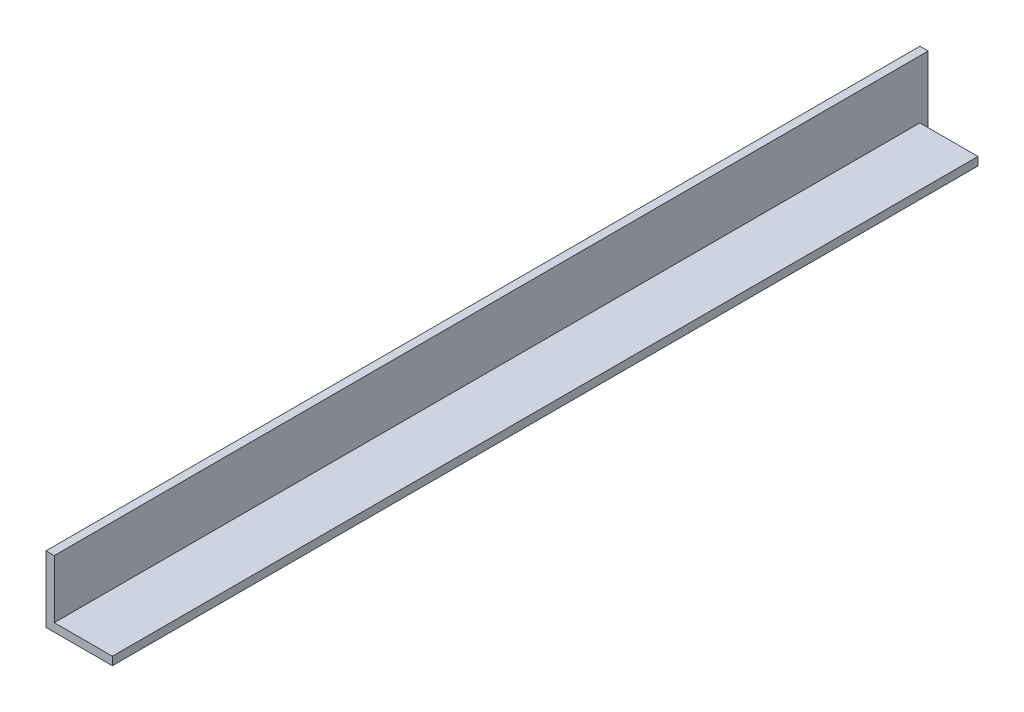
ISO-10303-21;
HEADER;
FILE_DESCRIPTION(('STEP AP214'),'2;1');
FILE_NAME('part.step','',(''),(''),'','','');
FILE_SCHEMA(('AUTOMOTIVE_DESIGN { 1 0 10303 214 1 1 1 1 }'));
ENDSEC;
DATA;
#1=APPLICATION_CONTEXT('core data for automotive mechanical design processes');
#2=APPLICATION_PROTOCOL_DEFINITION('international standard','automotive_design',2000,#1);
#3=PRODUCT_CONTEXT('',#1,'mechanical');
#4=PRODUCT('Part','Part','',(#3));
#5=PRODUCT_RELATED_PRODUCT_CATEGORY('part','',(#4));
#6=PRODUCT_DEFINITION_FORMATION('','',#4);
#7=PRODUCT_DEFINITION_CONTEXT('part definition',#1,'design');
#8=PRODUCT_DEFINITION('design','',#6,#7);
#9=PRODUCT_DEFINITION_SHAPE('','',#8);
#10=(LENGTH_UNIT() NAMED_UNIT(*) SI_UNIT(.MILLI.,.METRE.));
#11=(NAMED_UNIT(*) PLANE_ANGLE_UNIT() SI_UNIT($,.RADIAN.));
#12=(NAMED_UNIT(*) SI_UNIT($,.STERADIAN.) SOLID_ANGLE_UNIT());
#13=UNCERTAINTY_MEASURE_WITH_UNIT(LENGTH_MEASURE(1.E-05),#10,'distance_accuracy_value','');
#14=(GEOMETRIC_REPRESENTATION_CONTEXT(3) GLOBAL_UNCERTAINTY_ASSIGNED_CONTEXT((#13)) GLOBAL_UNIT_ASSIGNED_CONTEXT((#10,
#11,#12)) REPRESENTATION_CONTEXT('',''));
#15=CARTESIAN_POINT('',(0.,0.,0.));
#16=DIRECTION('',(0.,0.,1.));
#17=DIRECTION('',(1.,0.,0.));
#18=AXIS2_PLACEMENT_3D('',#15,#16,#17);
#19=CARTESIAN_POINT('',(0.,0.,501.65));
#20=DIRECTION('',(0.,1.,0.));
#21=DIRECTION('',(0.,0.,1.));
#22=AXIS2_PLACEMENT_3D('',#19,#20,#21);
#23=PLANE('',#22);
#24=DIRECTION('',(1.,0.,0.));
#25=VECTOR('',#24,1.);
#26=CARTESIAN_POINT('',(0.,0.,0.));
#27=LINE('',#26,#25);
#28=CARTESIAN_POINT('',(0.,0.,0.));
#29=VERTEX_POINT('',#28);
#30=CARTESIAN_POINT('',(4.7498,0.,0.));
#31=VERTEX_POINT('',#30);
#32=EDGE_CURVE('E115',#29,#31,#27,.T.);
#33=ORIENTED_EDGE('',*,*,#32,.T.);
#34=DIRECTION('',(0.,0.,-1.));
#35=VECTOR('',#34,1.);
#36=CARTESIAN_POINT('',(4.7498,0.,0.));
#37=LINE('',#36,#35);
#38=CARTESIAN_POINT('',(4.7498,0.,4.7752));
#39=VERTEX_POINT('',#38);
#40=EDGE_CURVE('E147',#39,#31,#37,.T.);
#41=ORIENTED_EDGE('',*,*,#40,.F.);
#42=DIRECTION('',(-1.,0.,0.));
#43=VECTOR('',#42,1.);
#44=CARTESIAN_POINT('',(4.7498,0.,4.7752));
#45=LINE('',#44,#43);
#46=CARTESIAN_POINT('',(38.1,0.,4.7752));
#47=VERTEX_POINT('',#46);
#48=EDGE_CURVE('E143',#47,#39,#45,.T.);
#49=ORIENTED_EDGE('',*,*,#48,.F.);
#50=DIRECTION('',(0.,0.,-1.));
#51=VECTOR('',#50,1.);
#52=CARTESIAN_POINT('',(38.1,0.,501.65));
#53=LINE('',#52,#51);
#54=CARTESIAN_POINT('',(38.1,0.,501.65));
#55=VERTEX_POINT('',#54);
#56=EDGE_CURVE('E11',#55,#47,#53,.T.);
#57=ORIENTED_EDGE('',*,*,#56,.F.);
#58=DIRECTION('',(1.,0.,0.));
#59=VECTOR('',#58,1.);
#60=CARTESIAN_POINT('',(0.,0.,501.65));
#61=LINE('',#60,#59);
#62=CARTESIAN_POINT('',(0.,0.,501.65));
#63=VERTEX_POINT('',#62);
#64=EDGE_CURVE('E123',#63,#55,#61,.T.);
#65=ORIENTED_EDGE('',*,*,#64,.F.);
#66=DIRECTION('',(0.,0.,-1.));
#67=VECTOR('',#66,1.);
#68=CARTESIAN_POINT('',(0.,0.,501.65));
#69=LINE('',#68,#67);
#70=EDGE_CURVE('E111',#63,#29,#69,.T.);
#71=ORIENTED_EDGE('',*,*,#70,.T.);
#72=EDGE_LOOP('',(#33,#41,#49,#57,#65,#71));
#73=FACE_BOUND('',#72,.T.);
#74=ADVANCED_FACE('F33',(#73),#23,.F.);
#75=CARTESIAN_POINT('',(38.1,0.,501.65));
#76=DIRECTION('',(-1.,0.,0.));
#77=DIRECTION('',(0.,0.,1.));
#78=AXIS2_PLACEMENT_3D('',#75,#76,#77);
#79=PLANE('',#78);
#80=ORIENTED_EDGE('',*,*,#56,.T.);
#81=DIRECTION('',(0.,-1.,0.));
#82=VECTOR('',#81,1.);
#83=CARTESIAN_POINT('',(38.1,38.1,4.7752));
#84=LINE('',#83,#82);
#85=CARTESIAN_POINT('',(38.1,4.74980000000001,4.7752));
#86=VERTEX_POINT('',#85);
#87=EDGE_CURVE('E136',#86,#47,#84,.T.);
#88=ORIENTED_EDGE('',*,*,#87,.F.);
#89=DIRECTION('',(0.,0.,-1.));
#90=VECTOR('',#89,1.);
#91=CARTESIAN_POINT('',(38.1,4.7498,501.65));
#92=LINE('',#91,#90);
#93=CARTESIAN_POINT('',(38.1,4.7498,501.65));
#94=VERTEX_POINT('',#93);
#95=EDGE_CURVE('E40',#94,#86,#92,.T.);
#96=ORIENTED_EDGE('',*,*,#95,.F.);
#97=DIRECTION('',(0.,1.,0.));
#98=VECTOR('',#97,1.);
#99=CARTESIAN_POINT('',(38.1,0.,501.65));
#100=LINE('',#99,#98);
#101=EDGE_CURVE('E82',#55,#94,#100,.T.);
#102=ORIENTED_EDGE('',*,*,#101,.F.);
#103=EDGE_LOOP('',(#80,#88,#96,#102));
#104=FACE_BOUND('',#103,.T.);
#105=ADVANCED_FACE('F134',(#104),#79,.F.);
#106=CARTESIAN_POINT('',(38.1,4.7498,501.65));
#107=DIRECTION('',(0.,-1.,0.));
#108=DIRECTION('',(1.,0.,0.));
#109=AXIS2_PLACEMENT_3D('',#106,#107,#108);
#110=PLANE('',#109);
#111=ORIENTED_EDGE('',*,*,#95,.T.);
#112=DIRECTION('',(-1.,0.,0.));
#113=VECTOR('',#112,1.);
#114=CARTESIAN_POINT('',(38.1,4.7498,4.77519999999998));
#115=LINE('',#114,#113);
#116=CARTESIAN_POINT('',(4.7498,4.74980000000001,4.7752));
#117=VERTEX_POINT('',#116);
#118=EDGE_CURVE('E118',#86,#117,#115,.T.);
#119=ORIENTED_EDGE('',*,*,#118,.T.);
#120=DIRECTION('',(0.,0.,-1.));
#121=VECTOR('',#120,1.);
#122=CARTESIAN_POINT('',(4.7498,4.7498,501.65));
#123=LINE('',#122,#121);
#124=CARTESIAN_POINT('',(4.7498,4.7498,501.65));
#125=VERTEX_POINT('',#124);
#126=EDGE_CURVE('E106',#125,#117,#123,.T.);
#127=ORIENTED_EDGE('',*,*,#126,.F.);
#128=DIRECTION('',(-1.,0.,0.));
#129=VECTOR('',#128,1.);
#130=CARTESIAN_POINT('',(38.1,4.7498,501.65));
#131=LINE('',#130,#129);
#132=EDGE_CURVE('E98',#94,#125,#131,.T.);
#133=ORIENTED_EDGE('',*,*,#132,.F.);
#134=EDGE_LOOP('',(#111,#119,#127,#133));
#135=FACE_BOUND('',#134,.T.);
#136=ADVANCED_FACE('F130',(#135),#110,.F.);
#137=CARTESIAN_POINT('',(4.7498,4.7498,501.65));
#138=DIRECTION('',(-1.,0.,0.));
#139=DIRECTION('',(0.,-1.,0.));
#140=AXIS2_PLACEMENT_3D('',#137,#138,#139);
#141=PLANE('',#140);
#142=ORIENTED_EDGE('',*,*,#126,.T.);
#143=DIRECTION('',(0.,-1.,0.));
#144=VECTOR('',#143,1.);
#145=CARTESIAN_POINT('',(4.7498,38.1,4.7752));
#146=LINE('',#145,#144);
#147=EDGE_CURVE('E142',#117,#39,#146,.T.);
#148=ORIENTED_EDGE('',*,*,#147,.T.);
#149=ORIENTED_EDGE('',*,*,#40,.T.);
#150=DIRECTION('',(0.,1.,0.));
#151=VECTOR('',#150,1.);
#152=CARTESIAN_POINT('',(4.7498,4.7498,0.));
#153=LINE('',#152,#151);
#154=CARTESIAN_POINT('',(4.7498,38.1,0.));
#155=VERTEX_POINT('',#154);
#156=EDGE_CURVE('E47',#31,#155,#153,.T.);
#157=ORIENTED_EDGE('',*,*,#156,.T.);
#158=DIRECTION('',(0.,0.,-1.));
#159=VECTOR('',#158,1.);
#160=CARTESIAN_POINT('',(4.7498,38.1,501.65));
#161=LINE('',#160,#159);
#162=CARTESIAN_POINT('',(4.7498,38.1,501.65));
#163=VERTEX_POINT('',#162);
#164=EDGE_CURVE('E103',#163,#155,#161,.T.);
#165=ORIENTED_EDGE('',*,*,#164,.F.);
#166=DIRECTION('',(0.,1.,0.));
#167=VECTOR('',#166,1.);
#168=CARTESIAN_POINT('',(4.7498,4.7498,501.65));
#169=LINE('',#168,#167);
#170=EDGE_CURVE('E91',#125,#163,#169,.T.);
#171=ORIENTED_EDGE('',*,*,#170,.F.);
#172=EDGE_LOOP('',(#142,#148,#149,#157,#165,#171));
#173=FACE_BOUND('',#172,.T.);
#174=ADVANCED_FACE('F104',(#173),#141,.F.);
#175=CARTESIAN_POINT('',(4.7498,38.1,501.65));
#176=DIRECTION('',(0.,-1.,0.));
#177=DIRECTION('',(0.,0.,-1.));
#178=AXIS2_PLACEMENT_3D('',#175,#176,#177);
#179=PLANE('',#178);
#180=DIRECTION('',(-1.,0.,0.));
#181=VECTOR('',#180,1.);
#182=CARTESIAN_POINT('',(4.7498,38.1,0.));
#183=LINE('',#182,#181);
#184=CARTESIAN_POINT('',(0.,38.1,0.));
#185=VERTEX_POINT('',#184);
#186=EDGE_CURVE('E120',#155,#185,#183,.T.);
#187=ORIENTED_EDGE('',*,*,#186,.T.);
#188=DIRECTION('',(0.,0.,-1.));
#189=VECTOR('',#188,1.);
#190=CARTESIAN_POINT('',(0.,38.1,501.65));
#191=LINE('',#190,#189);
#192=CARTESIAN_POINT('',(0.,38.1,501.65));
#193=VERTEX_POINT('',#192);
#194=EDGE_CURVE('E107',#193,#185,#191,.T.);
#195=ORIENTED_EDGE('',*,*,#194,.F.);
#196=DIRECTION('',(-1.,0.,0.));
#197=VECTOR('',#196,1.);
#198=CARTESIAN_POINT('',(4.7498,38.1,501.65));
#199=LINE('',#198,#197);
#200=EDGE_CURVE('E95',#163,#193,#199,.T.);
#201=ORIENTED_EDGE('',*,*,#200,.F.);
#202=ORIENTED_EDGE('',*,*,#164,.T.);
#203=EDGE_LOOP('',(#187,#195,#201,#202));
#204=FACE_BOUND('',#203,.T.);
#205=ADVANCED_FACE('F109',(#204),#179,.F.);
#206=CARTESIAN_POINT('',(0.,0.,501.65));
#207=DIRECTION('',(1.,0.,0.));
#208=DIRECTION('',(0.,0.,-1.));
#209=AXIS2_PLACEMENT_3D('',#206,#207,#208);
#210=PLANE('',#209);
#211=DIRECTION('',(0.,-1.,0.));
#212=VECTOR('',#211,1.);
#213=CARTESIAN_POINT('',(0.,0.,0.));
#214=LINE('',#213,#212);
#215=EDGE_CURVE('E74',#185,#29,#214,.T.);
#216=ORIENTED_EDGE('',*,*,#215,.T.);
#217=ORIENTED_EDGE('',*,*,#70,.F.);
#218=DIRECTION('',(0.,-1.,0.));
#219=VECTOR('',#218,1.);
#220=CARTESIAN_POINT('',(0.,0.,501.65));
#221=LINE('',#220,#219);
#222=EDGE_CURVE('E56',#193,#63,#221,.T.);
#223=ORIENTED_EDGE('',*,*,#222,.F.);
#224=ORIENTED_EDGE('',*,*,#194,.T.);
#225=EDGE_LOOP('',(#216,#217,#223,#224));
#226=FACE_BOUND('',#225,.T.);
#227=ADVANCED_FACE('F161',(#226),#210,.F.);
#228=CARTESIAN_POINT('',(38.1,0.,501.65));
#229=DIRECTION('',(0.,0.,1.));
#230=DIRECTION('',(1.,0.,0.));
#231=AXIS2_PLACEMENT_3D('',#228,#229,#230);
#232=PLANE('',#231);
#233=ORIENTED_EDGE('',*,*,#64,.T.);
#234=ORIENTED_EDGE('',*,*,#101,.T.);
#235=ORIENTED_EDGE('',*,*,#132,.T.);
#236=ORIENTED_EDGE('',*,*,#170,.T.);
#237=ORIENTED_EDGE('',*,*,#200,.T.);
#238=ORIENTED_EDGE('',*,*,#222,.T.);
#239=EDGE_LOOP('',(#233,#234,#235,#236,#237,#238));
#240=FACE_BOUND('',#239,.T.);
#241=ADVANCED_FACE('F93',(#240),#232,.T.);
#242=CARTESIAN_POINT('',(38.1,0.,0.));
#243=DIRECTION('',(0.,0.,1.));
#244=DIRECTION('',(1.,0.,0.));
#245=AXIS2_PLACEMENT_3D('',#242,#243,#244);
#246=PLANE('',#245);
#247=ORIENTED_EDGE('',*,*,#156,.F.);
#248=ORIENTED_EDGE('',*,*,#32,.F.);
#249=ORIENTED_EDGE('',*,*,#215,.F.);
#250=ORIENTED_EDGE('',*,*,#186,.F.);
#251=EDGE_LOOP('',(#247,#248,#249,#250));
#252=FACE_BOUND('',#251,.T.);
#253=ADVANCED_FACE('F160',(#252),#246,.F.);
#254=CARTESIAN_POINT('',(4.7498,38.1,4.7752));
#255=DIRECTION('',(0.,0.,1.));
#256=DIRECTION('',(1.,0.,0.));
#257=AXIS2_PLACEMENT_3D('',#254,#255,#256);
#258=PLANE('',#257);
#259=ORIENTED_EDGE('',*,*,#87,.T.);
#260=ORIENTED_EDGE('',*,*,#48,.T.);
#261=ORIENTED_EDGE('',*,*,#147,.F.);
#262=ORIENTED_EDGE('',*,*,#118,.F.);
#263=EDGE_LOOP('',(#259,#260,#261,#262));
#264=FACE_BOUND('',#263,.T.);
#265=ADVANCED_FACE('F157',(#264),#258,.F.);
#266=CLOSED_SHELL('',(#74,#105,#136,#174,#205,#227,#241,#253,#265));
#267=MANIFOLD_SOLID_BREP('B2',#266);
#268=ADVANCED_BREP_SHAPE_REPRESENTATION('',(#18,#267),#14);
#269=SHAPE_DEFINITION_REPRESENTATION(#9,#268);
ENDSEC;
END-ISO-10303-21;
